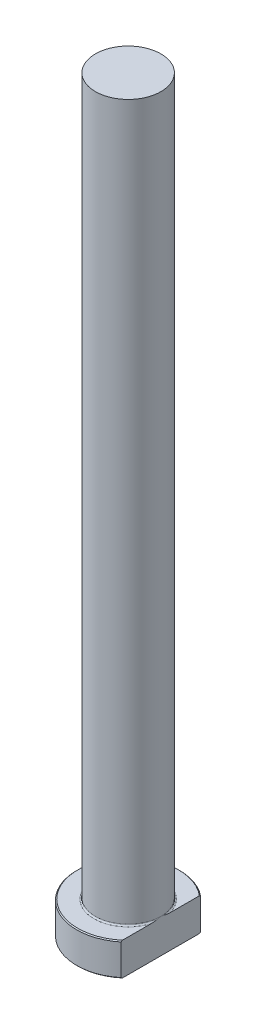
ISO-10303-21;
HEADER;
FILE_DESCRIPTION(('STEP AP214'),'2;1');
FILE_NAME('part.step','',(''),(''),'','','');
FILE_SCHEMA(('AUTOMOTIVE_DESIGN { 1 0 10303 214 1 1 1 1 }'));
ENDSEC;
DATA;
#1=APPLICATION_CONTEXT('core data for automotive mechanical design processes');
#2=APPLICATION_PROTOCOL_DEFINITION('international standard','automotive_design',2000,#1);
#3=PRODUCT_CONTEXT('',#1,'mechanical');
#4=PRODUCT('Part','Part','',(#3));
#5=PRODUCT_RELATED_PRODUCT_CATEGORY('part','',(#4));
#6=PRODUCT_DEFINITION_FORMATION('','',#4);
#7=PRODUCT_DEFINITION_CONTEXT('part definition',#1,'design');
#8=PRODUCT_DEFINITION('design','',#6,#7);
#9=PRODUCT_DEFINITION_SHAPE('','',#8);
#10=(LENGTH_UNIT() NAMED_UNIT(*) SI_UNIT(.MILLI.,.METRE.));
#11=(NAMED_UNIT(*) PLANE_ANGLE_UNIT() SI_UNIT($,.RADIAN.));
#12=(NAMED_UNIT(*) SI_UNIT($,.STERADIAN.) SOLID_ANGLE_UNIT());
#13=UNCERTAINTY_MEASURE_WITH_UNIT(LENGTH_MEASURE(1.E-05),#10,'distance_accuracy_value','');
#14=(GEOMETRIC_REPRESENTATION_CONTEXT(3) GLOBAL_UNCERTAINTY_ASSIGNED_CONTEXT((#13)) GLOBAL_UNIT_ASSIGNED_CONTEXT((#10,
#11,#12)) REPRESENTATION_CONTEXT('',''));
#15=CARTESIAN_POINT('',(0.,0.,0.));
#16=DIRECTION('',(0.,0.,1.));
#17=DIRECTION('',(1.,0.,0.));
#18=AXIS2_PLACEMENT_3D('',#15,#16,#17);
#19=CARTESIAN_POINT('',(0.,0.,0.));
#20=DIRECTION('',(0.,-1.,0.));
#21=DIRECTION('',(0.,0.,-1.));
#22=AXIS2_PLACEMENT_3D('',#19,#20,#21);
#23=PLANE('',#22);
#24=CARTESIAN_POINT('',(0.,0.,0.));
#25=DIRECTION('',(0.,-1.,0.));
#26=DIRECTION('',(0.,0.,-1.));
#27=AXIS2_PLACEMENT_3D('',#24,#25,#26);
#28=CIRCLE('',#27,10.7999999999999);
#29=CARTESIAN_POINT('',(6.99999999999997,0.,8.22435407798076));
#30=VERTEX_POINT('',#29);
#31=CARTESIAN_POINT('',(6.99999999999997,0.,-8.22435407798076));
#32=VERTEX_POINT('',#31);
#33=EDGE_CURVE('E98',#30,#32,#28,.T.);
#34=ORIENTED_EDGE('',*,*,#33,.T.);
#35=DIRECTION('',(0.,0.,1.));
#36=VECTOR('',#35,1.);
#37=CARTESIAN_POINT('',(6.99999999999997,0.,-8.48528137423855));
#38=LINE('',#37,#36);
#39=EDGE_CURVE('E83',#32,#30,#38,.T.);
#40=ORIENTED_EDGE('',*,*,#39,.T.);
#41=EDGE_LOOP('',(#34,#40));
#42=FACE_BOUND('',#41,.T.);
#43=ADVANCED_FACE('F32',(#42),#23,.T.);
#44=CARTESIAN_POINT('',(0.,259.958771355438,0.));
#45=DIRECTION('',(0.,1.,0.));
#46=DIRECTION('',(0.,0.,1.));
#47=AXIS2_PLACEMENT_3D('',#44,#45,#46);
#48=CYLINDRICAL_SURFACE('',#47,11.);
#49=CARTESIAN_POINT('',(0.,6.80000000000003,0.));
#50=DIRECTION('',(0.,1.,0.));
#51=DIRECTION('',(0.,0.,1.));
#52=AXIS2_PLACEMENT_3D('',#49,#50,#51);
#53=CIRCLE('',#52,11.);
#54=CARTESIAN_POINT('',(6.99999999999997,6.80000000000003,8.48528137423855));
#55=VERTEX_POINT('',#54);
#56=CARTESIAN_POINT('',(6.99999999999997,6.80000000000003,-8.48528137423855));
#57=VERTEX_POINT('',#56);
#58=EDGE_CURVE('E104',#55,#57,#53,.F.);
#59=ORIENTED_EDGE('',*,*,#58,.T.);
#60=DIRECTION('',(0.,-1.,0.));
#61=VECTOR('',#60,1.);
#62=CARTESIAN_POINT('',(6.99999999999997,160.,-8.48528137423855));
#63=LINE('',#62,#61);
#64=CARTESIAN_POINT('',(6.99999999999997,0.200000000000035,-8.48528137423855));
#65=VERTEX_POINT('',#64);
#66=EDGE_CURVE('E183',#57,#65,#63,.T.);
#67=ORIENTED_EDGE('',*,*,#66,.T.);
#68=CARTESIAN_POINT('',(0.,0.200000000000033,0.));
#69=DIRECTION('',(0.,-1.,0.));
#70=DIRECTION('',(0.,0.,-1.));
#71=AXIS2_PLACEMENT_3D('',#68,#69,#70);
#72=CIRCLE('',#71,11.);
#73=CARTESIAN_POINT('',(6.99999999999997,0.200000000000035,8.48528137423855));
#74=VERTEX_POINT('',#73);
#75=EDGE_CURVE('E100',#65,#74,#72,.F.);
#76=ORIENTED_EDGE('',*,*,#75,.T.);
#77=DIRECTION('',(0.,-1.,0.));
#78=VECTOR('',#77,1.);
#79=CARTESIAN_POINT('',(6.99999999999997,160.,8.48528137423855));
#80=LINE('',#79,#78);
#81=EDGE_CURVE('E93',#55,#74,#80,.T.);
#82=ORIENTED_EDGE('',*,*,#81,.F.);
#83=EDGE_LOOP('',(#59,#67,#76,#82));
#84=FACE_BOUND('',#83,.T.);
#85=ADVANCED_FACE('F158',(#84),#48,.T.);
#86=CARTESIAN_POINT('',(-11.,7.,0.));
#87=DIRECTION('',(0.,1.,0.));
#88=DIRECTION('',(0.,0.,1.));
#89=AXIS2_PLACEMENT_3D('',#86,#87,#88);
#90=PLANE('',#89);
#91=CARTESIAN_POINT('',(0.,7.,0.));
#92=DIRECTION('',(0.,1.,0.));
#93=DIRECTION('',(0.,0.,1.));
#94=AXIS2_PLACEMENT_3D('',#91,#92,#93);
#95=CIRCLE('',#94,10.8);
#96=CARTESIAN_POINT('',(6.99999999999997,7.,-8.22435407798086));
#97=VERTEX_POINT('',#96);
#98=CARTESIAN_POINT('',(6.99999999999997,7.,8.22435407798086));
#99=VERTEX_POINT('',#98);
#100=EDGE_CURVE('E178',#97,#99,#95,.T.);
#101=ORIENTED_EDGE('',*,*,#100,.T.);
#102=DIRECTION('',(0.,0.,-1.));
#103=VECTOR('',#102,1.);
#104=CARTESIAN_POINT('',(6.99999999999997,7.,0.));
#105=LINE('',#104,#103);
#106=CARTESIAN_POINT('',(6.99999999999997,6.99999999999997,2.07123151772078));
#107=VERTEX_POINT('',#106);
#108=EDGE_CURVE('E57',#99,#107,#105,.T.);
#109=ORIENTED_EDGE('',*,*,#108,.T.);
#110=CARTESIAN_POINT('',(0.,7.,0.));
#111=DIRECTION('',(0.,1.,0.));
#112=DIRECTION('',(0.,0.,1.));
#113=AXIS2_PLACEMENT_3D('',#110,#111,#112);
#114=CIRCLE('',#113,7.29999999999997);
#115=CARTESIAN_POINT('',(6.99999999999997,6.99999999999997,-2.07123151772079));
#116=VERTEX_POINT('',#115);
#117=EDGE_CURVE('E107',#107,#116,#114,.F.);
#118=ORIENTED_EDGE('',*,*,#117,.T.);
#119=EDGE_CURVE('E136',#116,#97,#105,.T.);
#120=ORIENTED_EDGE('',*,*,#119,.T.);
#121=EDGE_LOOP('',(#101,#109,#118,#120));
#122=FACE_BOUND('',#121,.T.);
#123=ADVANCED_FACE('F147',(#122),#90,.T.);
#124=CARTESIAN_POINT('',(0.,7.00000000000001,0.));
#125=DIRECTION('',(0.,-1.,0.));
#126=DIRECTION('',(0.,0.,-1.));
#127=AXIS2_PLACEMENT_3D('',#124,#125,#126);
#128=CONICAL_SURFACE('',#127,10.8,0.785398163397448);
#129=ORIENTED_EDGE('',*,*,#58,.F.);
#130=CARTESIAN_POINT('',(6.99999999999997,-2.13774979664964,18.6685261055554));
#131=CARTESIAN_POINT('',(6.99999999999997,-1.86574872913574,18.3780244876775));
#132=CARTESIAN_POINT('',(6.99999999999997,-1.59415659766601,18.0871392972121));
#133=CARTESIAN_POINT('',(6.99999999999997,-1.05192877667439,17.5044755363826));
#134=CARTESIAN_POINT('',(6.99999999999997,-0.781293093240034,17.2126969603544));
#135=CARTESIAN_POINT('',(6.99999999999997,-0.241050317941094,16.628048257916));
#136=CARTESIAN_POINT('',(6.99999999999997,0.0285564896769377,16.3351778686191));
#137=CARTESIAN_POINT('',(6.99999999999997,0.566485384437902,15.7482616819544));
#138=CARTESIAN_POINT('',(6.99999999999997,0.834807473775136,15.4542158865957));
#139=CARTESIAN_POINT('',(6.99999999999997,1.64198377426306,14.5651645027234));
#140=CARTESIAN_POINT('',(6.99999999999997,2.17856420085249,13.968084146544));
#141=CARTESIAN_POINT('',(6.99999999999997,2.97696333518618,13.0668144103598));
#142=CARTESIAN_POINT('',(6.99999999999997,3.24199785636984,12.7654727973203));
#143=CARTESIAN_POINT('',(6.99999999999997,3.76945856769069,12.160514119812));
#144=CARTESIAN_POINT('',(6.99999999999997,4.03188476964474,11.8568970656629));
#145=CARTESIAN_POINT('',(6.99999999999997,4.50733797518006,11.3009625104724));
#146=CARTESIAN_POINT('',(6.99999999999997,4.72088020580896,11.0490858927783));
#147=CARTESIAN_POINT('',(6.99999999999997,5.14538078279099,10.5431655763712));
#148=CARTESIAN_POINT('',(6.99999999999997,5.35633915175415,10.2891218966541));
#149=CARTESIAN_POINT('',(6.99999999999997,5.77522964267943,9.77836737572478));
#150=CARTESIAN_POINT('',(6.99999999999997,5.98316044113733,9.52165544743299));
#151=CARTESIAN_POINT('',(6.99999999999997,6.39521098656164,9.00519084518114));
#152=CARTESIAN_POINT('',(6.99999999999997,6.59933078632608,8.74543821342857));
#153=CARTESIAN_POINT('',(6.99999999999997,7.00243445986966,8.22283607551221));
#154=CARTESIAN_POINT('',(6.99999999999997,7.20142819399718,7.95999419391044));
#155=CARTESIAN_POINT('',(6.99999999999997,7.59353840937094,7.42991856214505));
#156=CARTESIAN_POINT('',(6.99999999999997,7.78665447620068,7.16268450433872));
#157=CARTESIAN_POINT('',(6.99999999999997,8.16523718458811,6.62311113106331));
#158=CARTESIAN_POINT('',(6.99999999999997,8.35070911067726,6.35077553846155));
#159=CARTESIAN_POINT('',(6.99999999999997,8.71189725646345,5.7997373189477));
#160=CARTESIAN_POINT('',(6.99999999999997,8.88761537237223,5.52103594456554));
#161=CARTESIAN_POINT('',(6.99999999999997,9.19554959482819,5.00707921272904));
#162=CARTESIAN_POINT('',(6.99999999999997,9.32988075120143,4.77309669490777));
#163=CARTESIAN_POINT('',(6.99999999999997,9.58764253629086,4.29911523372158));
#164=CARTESIAN_POINT('',(6.99999999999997,9.71107181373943,4.05911554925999));
#165=CARTESIAN_POINT('',(6.99999999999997,9.94390907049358,3.57263619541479));
#166=CARTESIAN_POINT('',(6.99999999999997,10.0533307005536,3.32616312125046));
#167=CARTESIAN_POINT('',(6.99999999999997,10.2545146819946,2.826071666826));
#168=CARTESIAN_POINT('',(6.99999999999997,10.3462820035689,2.57245532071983));
#169=CARTESIAN_POINT('',(6.99999999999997,10.4907049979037,2.112544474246));
#170=CARTESIAN_POINT('',(6.99999999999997,10.5475277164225,1.9075661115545));
#171=CARTESIAN_POINT('',(6.99999999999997,10.6452043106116,1.49381161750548));
#172=CARTESIAN_POINT('',(6.99999999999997,10.6860603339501,1.28503600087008));
#173=CARTESIAN_POINT('',(6.99999999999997,10.749755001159,0.865342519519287));
#174=CARTESIAN_POINT('',(6.99999999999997,10.7726462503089,0.654432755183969));
#175=CARTESIAN_POINT('',(6.99999999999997,10.7993569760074,0.231396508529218));
#176=CARTESIAN_POINT('',(6.99999999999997,10.8031771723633,0.0192700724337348));
#177=CARTESIAN_POINT('',(6.99999999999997,10.7915178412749,-0.404715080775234));
#178=CARTESIAN_POINT('',(6.99999999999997,10.77601357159,-0.616573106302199));
#179=CARTESIAN_POINT('',(6.99999999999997,10.7265413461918,-1.0381044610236));
#180=CARTESIAN_POINT('',(6.99999999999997,10.6925718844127,-1.24777761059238));
#181=CARTESIAN_POINT('',(6.99999999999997,10.607770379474,-1.66430273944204));
#182=CARTESIAN_POINT('',(6.99999999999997,10.5568873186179,-1.87114418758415));
#183=CARTESIAN_POINT('',(6.99999999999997,10.4404729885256,-2.28061279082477));
#184=CARTESIAN_POINT('',(6.99999999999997,10.3749414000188,-2.48323985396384));
#185=CARTESIAN_POINT('',(6.99999999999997,10.219098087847,-2.91860265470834));
#186=CARTESIAN_POINT('',(6.99999999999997,10.1264616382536,-3.15050038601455));
#187=CARTESIAN_POINT('',(6.99999999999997,9.9274095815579,-3.60835455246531));
#188=CARTESIAN_POINT('',(6.99999999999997,9.82098769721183,-3.83430822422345));
#189=CARTESIAN_POINT('',(6.99999999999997,9.59695142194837,-4.28105341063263));
#190=CARTESIAN_POINT('',(6.99999999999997,9.47931762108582,-4.50183511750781));
#191=CARTESIAN_POINT('',(6.99999999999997,9.23524231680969,-4.93840249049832));
#192=CARTESIAN_POINT('',(6.99999999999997,9.10880204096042,-5.15418884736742));
#193=CARTESIAN_POINT('',(6.99999999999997,8.84714657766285,-5.584179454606));
#194=CARTESIAN_POINT('',(6.99999999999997,8.71183920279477,-5.7983273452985));
#195=CARTESIAN_POINT('',(6.99999999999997,8.43533082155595,-6.22277635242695));
#196=CARTESIAN_POINT('',(6.99999999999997,8.29412966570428,-6.43307737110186));
#197=CARTESIAN_POINT('',(6.99999999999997,8.00706556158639,-6.85014007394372));
#198=CARTESIAN_POINT('',(6.99999999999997,7.8612076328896,-7.05690522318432));
#199=CARTESIAN_POINT('',(6.99999999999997,7.56553131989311,-7.46757278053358));
#200=CARTESIAN_POINT('',(6.99999999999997,7.41571298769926,-7.67147522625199));
#201=CARTESIAN_POINT('',(6.99999999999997,7.07999705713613,-8.12067189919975));
#202=CARTESIAN_POINT('',(6.99999999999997,6.89330819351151,-8.36537403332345));
#203=CARTESIAN_POINT('',(6.99999999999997,6.51597189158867,-8.85171196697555));
#204=CARTESIAN_POINT('',(6.99999999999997,6.32532432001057,-9.09334766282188));
#205=CARTESIAN_POINT('',(6.99999999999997,5.94076020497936,-9.57404667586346));
#206=CARTESIAN_POINT('',(6.99999999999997,5.74684327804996,-9.81310968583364));
#207=CARTESIAN_POINT('',(6.99999999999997,5.35630729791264,-10.2890203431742));
#208=CARTESIAN_POINT('',(6.99999999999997,5.15968820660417,-10.5258679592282));
#209=CARTESIAN_POINT('',(6.99999999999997,4.56606953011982,-11.2340330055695));
#210=CARTESIAN_POINT('',(6.99999999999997,4.16568148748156,-11.7025100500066));
#211=CARTESIAN_POINT('',(6.99999999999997,3.35840033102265,-12.6338245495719));
#212=CARTESIAN_POINT('',(6.99999999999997,2.95150704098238,-13.0966618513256));
#213=CARTESIAN_POINT('',(6.99999999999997,2.35017562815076,-13.7734103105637));
#214=CARTESIAN_POINT('',(6.99999999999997,2.15763812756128,-13.9890143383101));
#215=CARTESIAN_POINT('',(6.99999999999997,1.7716160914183,-14.4193671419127));
#216=CARTESIAN_POINT('',(6.99999999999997,1.57813157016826,-14.6341159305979));
#217=CARTESIAN_POINT('',(6.99999999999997,0.996412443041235,-15.277238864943));
#218=CARTESIAN_POINT('',(6.99999999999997,0.606922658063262,-15.7044779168));
#219=CARTESIAN_POINT('',(6.99999999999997,-0.173895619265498,-16.555652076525));
#220=CARTESIAN_POINT('',(6.99999999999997,-0.565218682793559,-16.9795921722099));
#221=CARTESIAN_POINT('',(6.99999999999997,-1.34999931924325,-17.8254589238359));
#222=CARTESIAN_POINT('',(6.99999999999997,-1.74345679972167,-18.2473856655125));
#223=CARTESIAN_POINT('',(6.99999999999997,-2.13774979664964,-18.6685261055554));
#224=B_SPLINE_CURVE_WITH_KNOTS('',3,(#130,#131,#132,#133,#134,#135,#136,#137,#138,#139,#140,
#141,#142,#143,#144,#145,#146,#147,#148,#149,#150,#151,#152,#153,#154,#155,#156,#157,#158,#159,
#160,#161,#162,#163,#164,#165,#166,#167,#168,#169,#170,#171,#172,#173,#174,#175,#176,#177,#178,
#179,#180,#181,#182,#183,#184,#185,#186,#187,#188,#189,#190,#191,#192,#193,#194,#195,#196,#197,
#198,#199,#200,#201,#202,#203,#204,#205,#206,#207,#208,#209,#210,#211,#212,#213,#214,#215,#216,
#217,#218,#219,#220,#221,#222,#223),.UNSPECIFIED.,.F.,.F.,(4,2,2,2,2,2,2,2,2,2,2,2,2,2,2,2,2,2,
2,2,2,2,2,2,2,2,2,2,2,2,2,2,2,2,2,2,2,2,2,2,2,2,2,2,2,2,4),(0.,1.19389386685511,
2.38779531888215,3.58200567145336,4.77621398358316,7.18442154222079,8.38834194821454,
9.5922568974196,10.5828886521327,11.5735117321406,12.5645555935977,13.5555857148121,
14.544540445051,15.5335647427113,16.5218934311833,17.5100293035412,18.3192088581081,
19.1284885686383,19.9369735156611,20.7452305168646,21.3828127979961,22.0203092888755,
22.6559319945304,23.2915307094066,23.9279440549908,24.5644093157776,25.2028120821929,
25.8412287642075,26.5898097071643,27.338732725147,28.0889766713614,28.8391162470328,
29.5989369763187,30.3587769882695,31.1178239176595,31.8768608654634,32.800165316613,
33.7235009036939,34.6469455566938,35.5704032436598,37.4191008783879,39.2678486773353,
40.1350269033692,41.0021920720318,42.7365692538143,44.4673795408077,46.1981154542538),.UNSPECIFIED.);
#225=EDGE_CURVE('E135',#55,#99,#224,.T.);
#226=ORIENTED_EDGE('',*,*,#225,.T.);
#227=ORIENTED_EDGE('',*,*,#100,.F.);
#228=EDGE_CURVE('E127',#97,#57,#224,.T.);
#229=ORIENTED_EDGE('',*,*,#228,.T.);
#230=EDGE_LOOP('',(#129,#226,#227,#229));
#231=FACE_BOUND('',#230,.T.);
#232=ADVANCED_FACE('F143',(#231),#128,.T.);
#233=CARTESIAN_POINT('',(0.,0.200000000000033,0.));
#234=DIRECTION('',(0.,1.,0.));
#235=DIRECTION('',(0.,0.,1.));
#236=AXIS2_PLACEMENT_3D('',#233,#234,#235);
#237=CONICAL_SURFACE('',#236,11.,0.785398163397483);
#238=ORIENTED_EDGE('',*,*,#75,.F.);
#239=CARTESIAN_POINT('',(6.99999999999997,9.13774979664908,-18.6685261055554));
#240=CARTESIAN_POINT('',(6.99999999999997,8.86574872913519,-18.3780244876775));
#241=CARTESIAN_POINT('',(6.99999999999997,8.59415659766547,-18.0871392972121));
#242=CARTESIAN_POINT('',(6.99999999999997,8.05192877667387,-17.5044755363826));
#243=CARTESIAN_POINT('',(6.99999999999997,7.78129309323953,-17.2126969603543));
#244=CARTESIAN_POINT('',(6.99999999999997,7.24105031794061,-16.6280482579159));
#245=CARTESIAN_POINT('',(6.99999999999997,6.97144351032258,-16.335177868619));
#246=CARTESIAN_POINT('',(6.99999999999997,6.43351461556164,-15.7482616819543));
#247=CARTESIAN_POINT('',(6.99999999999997,6.16519252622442,-15.4542158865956));
#248=CARTESIAN_POINT('',(6.99999999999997,5.35801622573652,-14.5651645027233));
#249=CARTESIAN_POINT('',(6.99999999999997,4.82143579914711,-13.9680841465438));
#250=CARTESIAN_POINT('',(6.99999999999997,4.02303666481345,-13.0668144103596));
#251=CARTESIAN_POINT('',(6.99999999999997,3.7580021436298,-12.7654727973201));
#252=CARTESIAN_POINT('',(6.99999999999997,3.23054143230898,-12.1605141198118));
#253=CARTESIAN_POINT('',(6.99999999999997,2.96811523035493,-11.8568970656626));
#254=CARTESIAN_POINT('',(6.99999999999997,2.4926620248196,-11.3009625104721));
#255=CARTESIAN_POINT('',(6.99999999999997,2.27911979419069,-11.0490858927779));
#256=CARTESIAN_POINT('',(6.99999999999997,1.85461921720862,-10.5431655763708));
#257=CARTESIAN_POINT('',(6.99999999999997,1.64366084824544,-10.2891218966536));
#258=CARTESIAN_POINT('',(6.99999999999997,1.22477035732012,-9.77836737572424));
#259=CARTESIAN_POINT('',(6.99999999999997,1.0168395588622,-9.52165544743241));
#260=CARTESIAN_POINT('',(6.99999999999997,0.60478901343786,-9.00519084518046));
#261=CARTESIAN_POINT('',(6.99999999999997,0.400669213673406,-8.74543821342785));
#262=CARTESIAN_POINT('',(6.99999999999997,-0.00243445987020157,-8.2228360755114));
#263=CARTESIAN_POINT('',(6.99999999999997,-0.201428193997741,-7.95999419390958));
#264=CARTESIAN_POINT('',(6.99999999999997,-0.593538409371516,-7.4299185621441));
#265=CARTESIAN_POINT('',(6.99999999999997,-0.786654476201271,-7.16268450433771));
#266=CARTESIAN_POINT('',(6.99999999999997,-1.16523718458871,-6.6231111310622));
#267=CARTESIAN_POINT('',(6.99999999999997,-1.35070911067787,-6.3507755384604));
#268=CARTESIAN_POINT('',(6.99999999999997,-1.71189725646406,-5.79973731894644));
#269=CARTESIAN_POINT('',(6.99999999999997,-1.88761537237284,-5.52103594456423));
#270=CARTESIAN_POINT('',(6.99999999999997,-2.19554959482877,-5.00707921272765));
#271=CARTESIAN_POINT('',(6.99999999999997,-2.32988075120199,-4.77309669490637));
#272=CARTESIAN_POINT('',(6.99999999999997,-2.58764253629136,-4.29911523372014));
#273=CARTESIAN_POINT('',(6.99999999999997,-2.7110718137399,-4.05911554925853));
#274=CARTESIAN_POINT('',(6.99999999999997,-2.94390907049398,-3.5726361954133));
#275=CARTESIAN_POINT('',(6.99999999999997,-3.05333070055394,-3.32616312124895));
#276=CARTESIAN_POINT('',(6.99999999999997,-3.25451468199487,-2.82607166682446));
#277=CARTESIAN_POINT('',(6.99999999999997,-3.34628200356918,-2.57245532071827));
#278=CARTESIAN_POINT('',(6.99999999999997,-3.49070499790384,-2.11254447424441));
#279=CARTESIAN_POINT('',(6.99999999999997,-3.54752771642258,-1.90756611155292));
#280=CARTESIAN_POINT('',(6.99999999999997,-3.64520431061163,-1.49381161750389));
#281=CARTESIAN_POINT('',(6.99999999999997,-3.68606033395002,-1.2850360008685));
#282=CARTESIAN_POINT('',(6.99999999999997,-3.74975500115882,-0.865342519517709));
#283=CARTESIAN_POINT('',(6.99999999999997,-3.77264625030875,-0.654432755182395));
#284=CARTESIAN_POINT('',(6.99999999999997,-3.79935697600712,-0.231396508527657));
#285=CARTESIAN_POINT('',(6.99999999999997,-3.80317717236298,-0.0192700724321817));
#286=CARTESIAN_POINT('',(6.99999999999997,-3.79151784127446,0.404715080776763));
#287=CARTESIAN_POINT('',(6.99999999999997,-3.77601357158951,0.61657310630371));
#288=CARTESIAN_POINT('',(6.99999999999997,-3.72654134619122,1.03810446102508));
#289=CARTESIAN_POINT('',(6.99999999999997,-3.69257188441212,1.24777761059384));
#290=CARTESIAN_POINT('',(6.99999999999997,-3.60777037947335,1.66430273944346));
#291=CARTESIAN_POINT('',(6.99999999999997,-3.55688731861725,1.87114418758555));
#292=CARTESIAN_POINT('',(6.99999999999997,-3.44047298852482,2.28061279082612));
#293=CARTESIAN_POINT('',(6.99999999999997,-3.374941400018,2.48323985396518));
#294=CARTESIAN_POINT('',(6.99999999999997,-3.2190980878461,2.91860265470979));
#295=CARTESIAN_POINT('',(6.99999999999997,-3.12646163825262,3.15050038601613));
#296=CARTESIAN_POINT('',(6.99999999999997,-2.92740958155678,3.60835455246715));
#297=CARTESIAN_POINT('',(6.99999999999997,-2.82098769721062,3.83430822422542));
#298=CARTESIAN_POINT('',(6.99999999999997,-2.59695142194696,4.28105341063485));
#299=CARTESIAN_POINT('',(6.99999999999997,-2.4793176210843,4.50183511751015));
#300=CARTESIAN_POINT('',(6.99999999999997,-2.23524231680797,4.9384024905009));
#301=CARTESIAN_POINT('',(6.99999999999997,-2.1088020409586,5.15418884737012));
#302=CARTESIAN_POINT('',(6.99999999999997,-1.84714657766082,5.58417945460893));
#303=CARTESIAN_POINT('',(6.99999999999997,-1.71183920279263,5.79832734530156));
#304=CARTESIAN_POINT('',(6.99999999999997,-1.43533082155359,6.22277635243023));
#305=CARTESIAN_POINT('',(6.99999999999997,-1.29412966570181,6.43307737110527));
#306=CARTESIAN_POINT('',(6.99999999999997,-1.00706556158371,6.85014007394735));
#307=CARTESIAN_POINT('',(6.99999999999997,-0.861207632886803,7.05690522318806));
#308=CARTESIAN_POINT('',(6.99999999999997,-0.5655313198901,7.46757278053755));
#309=CARTESIAN_POINT('',(6.99999999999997,-0.415712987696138,7.67147522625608));
#310=CARTESIAN_POINT('',(6.99999999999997,-0.0799970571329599,8.12067189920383));
#311=CARTESIAN_POINT('',(6.99999999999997,0.10669180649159,8.36537403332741));
#312=CARTESIAN_POINT('',(6.99999999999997,0.484028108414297,8.85171196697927));
#313=CARTESIAN_POINT('',(6.99999999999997,0.674675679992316,9.09334766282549));
#314=CARTESIAN_POINT('',(6.99999999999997,1.05923979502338,9.57404667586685));
#315=CARTESIAN_POINT('',(6.99999999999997,1.25315672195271,9.81310968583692));
#316=CARTESIAN_POINT('',(6.99999999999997,1.64369270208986,10.2890203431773));
#317=CARTESIAN_POINT('',(6.99999999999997,1.84031179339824,10.5258679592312));
#318=CARTESIAN_POINT('',(6.99999999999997,2.43393046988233,11.2340330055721));
#319=CARTESIAN_POINT('',(6.99999999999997,2.83431851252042,11.702510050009));
#320=CARTESIAN_POINT('',(6.99999999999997,3.64159966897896,12.633824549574));
#321=CARTESIAN_POINT('',(6.99999999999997,4.04849295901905,13.0966618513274));
#322=CARTESIAN_POINT('',(6.99999999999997,4.64982437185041,13.7734103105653));
#323=CARTESIAN_POINT('',(6.99999999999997,4.84236187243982,13.9890143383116));
#324=CARTESIAN_POINT('',(6.99999999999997,5.22838390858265,14.4193671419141));
#325=CARTESIAN_POINT('',(6.99999999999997,5.42186842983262,14.6341159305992));
#326=CARTESIAN_POINT('',(6.99999999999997,6.00358755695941,15.2772388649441));
#327=CARTESIAN_POINT('',(6.99999999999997,6.39307734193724,15.7044779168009));
#328=CARTESIAN_POINT('',(6.99999999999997,7.17389561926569,16.5556520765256));
#329=CARTESIAN_POINT('',(6.99999999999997,7.5652186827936,16.9795921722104));
#330=CARTESIAN_POINT('',(6.99999999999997,8.34999931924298,17.8254589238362));
#331=CARTESIAN_POINT('',(6.99999999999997,8.74345679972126,18.2473856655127));
#332=CARTESIAN_POINT('',(6.99999999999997,9.13774979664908,18.6685261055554));
#333=B_SPLINE_CURVE_WITH_KNOTS('',3,(#239,#240,#241,#242,#243,#244,#245,#246,#247,#248,#249,
#250,#251,#252,#253,#254,#255,#256,#257,#258,#259,#260,#261,#262,#263,#264,#265,#266,#267,#268,
#269,#270,#271,#272,#273,#274,#275,#276,#277,#278,#279,#280,#281,#282,#283,#284,#285,#286,#287,
#288,#289,#290,#291,#292,#293,#294,#295,#296,#297,#298,#299,#300,#301,#302,#303,#304,#305,#306,
#307,#308,#309,#310,#311,#312,#313,#314,#315,#316,#317,#318,#319,#320,#321,#322,#323,#324,#325,
#326,#327,#328,#329,#330,#331,#332),.UNSPECIFIED.,.F.,.F.,(4,2,2,2,2,2,2,2,2,2,2,2,2,2,2,2,2,2,
2,2,2,2,2,2,2,2,2,2,2,2,2,2,2,2,2,2,2,2,2,2,2,2,2,2,2,2,4),(0.,1.19389386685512,
2.38779531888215,3.58200567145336,4.77621398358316,7.18442154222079,8.38834194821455,
9.59225689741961,10.5828886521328,11.5735117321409,12.5645555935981,13.5555857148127,
14.5445404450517,15.5335647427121,16.5218934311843,17.5100293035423,18.3192088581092,
19.1284885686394,19.9369735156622,20.7452305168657,21.3828127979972,22.0203092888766,
22.6559319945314,23.2915307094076,23.9279440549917,24.5644093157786,25.2028120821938,
25.8412287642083,26.5898097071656,27.3387327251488,28.0889766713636,28.8391162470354,
29.5989369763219,30.3587769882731,31.1178239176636,31.876860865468,32.8001653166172,
33.7235009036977,34.6469455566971,35.5704032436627,37.41910087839,39.2678486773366,
40.1350269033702,41.0021920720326,42.7365692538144,44.4673795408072,46.1981154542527),.UNSPECIFIED.);
#334=EDGE_CURVE('E86',#65,#32,#333,.T.);
#335=ORIENTED_EDGE('',*,*,#334,.T.);
#336=ORIENTED_EDGE('',*,*,#33,.F.);
#337=EDGE_CURVE('E89',#30,#74,#333,.T.);
#338=ORIENTED_EDGE('',*,*,#337,.T.);
#339=EDGE_LOOP('',(#238,#335,#336,#338));
#340=FACE_BOUND('',#339,.T.);
#341=ADVANCED_FACE('F97',(#340),#237,.T.);
#342=CARTESIAN_POINT('',(0.,7.29999999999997,0.));
#343=DIRECTION('',(0.,1.,0.));
#344=DIRECTION('',(0.,0.,1.));
#345=AXIS2_PLACEMENT_3D('',#342,#343,#344);
#346=TOROIDAL_SURFACE('',#345,7.29999999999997,0.3);
#347=CARTESIAN_POINT('',(6.99999999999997,7.29999999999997,0.));
#348=CARTESIAN_POINT('',(6.99999999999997,7.30000062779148,2.32628005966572E-11));
#349=CARTESIAN_POINT('',(6.99999999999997,7.30000125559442,-3.16909134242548E-07));
#350=CARTESIAN_POINT('',(6.99999999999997,7.30000241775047,-1.14637029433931E-06));
#351=CARTESIAN_POINT('',(6.99999999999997,7.30000292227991,-1.68168827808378E-06));
#352=CARTESIAN_POINT('',(6.99999999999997,7.30000400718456,-2.97869768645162E-06));
#353=CARTESIAN_POINT('',(6.99999999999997,7.30000456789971,-3.76131367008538E-06));
#354=CARTESIAN_POINT('',(6.99999999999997,7.30000553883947,-5.35167977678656E-06));
#355=CARTESIAN_POINT('',(6.99999999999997,7.30000595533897,-6.15604635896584E-06));
#356=CARTESIAN_POINT('',(6.99999999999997,7.30000758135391,-9.388029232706E-06));
#357=CARTESIAN_POINT('',(6.99999999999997,7.30000871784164,-1.18573464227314E-05));
#358=CARTESIAN_POINT('',(6.99999999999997,7.30001050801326,-1.66549715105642E-05));
#359=CARTESIAN_POINT('',(6.99999999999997,7.30001120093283,-1.89691200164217E-05));
#360=CARTESIAN_POINT('',(6.99999999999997,7.30001423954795,-2.9073526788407E-05));
#361=CARTESIAN_POINT('',(6.99999999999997,7.30001661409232,-3.68567169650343E-05));
#362=CARTESIAN_POINT('',(6.99999999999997,7.30001997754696,-5.13387672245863E-05));
#363=CARTESIAN_POINT('',(6.99999999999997,7.30002113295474,-5.79981986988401E-05));
#364=CARTESIAN_POINT('',(6.99999999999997,7.30002974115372,-0.000108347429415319));
#365=CARTESIAN_POINT('',(6.99999999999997,7.30003649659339,-0.000152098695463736));
#366=CARTESIAN_POINT('',(6.99999999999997,7.30006604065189,-0.000326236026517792));
#367=CARTESIAN_POINT('',(6.99999999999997,7.30009398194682,-0.000455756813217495));
#368=CARTESIAN_POINT('',(6.99999999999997,7.30020370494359,-0.000971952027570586));
#369=CARTESIAN_POINT('',(6.99999999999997,7.30028233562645,-0.00135905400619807));
#370=CARTESIAN_POINT('',(6.99999999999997,7.30059908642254,-0.00290811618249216));
#371=CARTESIAN_POINT('',(6.99999999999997,7.30084128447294,-0.00406949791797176));
#372=CARTESIAN_POINT('',(6.99999999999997,7.30185637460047,-0.00894870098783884));
#373=CARTESIAN_POINT('',(6.99999999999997,7.30262406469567,-0.0126672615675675));
#374=CARTESIAN_POINT('',(6.99999999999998,7.30904362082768,-0.0437472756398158));
#375=CARTESIAN_POINT('',(6.99999999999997,7.31471492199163,-0.0711060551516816));
#376=CARTESIAN_POINT('',(6.99999999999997,7.3257989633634,-0.124711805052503));
#377=CARTESIAN_POINT('',(6.99999999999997,7.33121280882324,-0.150958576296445));
#378=CARTESIAN_POINT('',(6.99999999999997,7.34888721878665,-0.236855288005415));
#379=CARTESIAN_POINT('',(6.99999999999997,7.36109504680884,-0.296516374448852));
#380=CARTESIAN_POINT('',(6.99999999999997,7.38163193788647,-0.398125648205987));
#381=CARTESIAN_POINT('',(6.99999999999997,7.39003371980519,-0.440059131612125));
#382=CARTESIAN_POINT('',(6.99999999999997,7.40641913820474,-0.522820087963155));
#383=CARTESIAN_POINT('',(6.99999999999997,7.41440792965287,-0.563646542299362));
#384=CARTESIAN_POINT('',(6.99999999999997,7.44025584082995,-0.697745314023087));
#385=CARTESIAN_POINT('',(6.99999999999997,7.45763052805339,-0.791112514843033));
#386=CARTESIAN_POINT('',(6.99999999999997,7.4907040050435,-0.979068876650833));
#387=CARTESIAN_POINT('',(6.99999999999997,7.50638514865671,-1.07366117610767));
#388=CARTESIAN_POINT('',(6.99999999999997,7.53649600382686,-1.27237182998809));
#389=CARTESIAN_POINT('',(6.99999999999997,7.55066037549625,-1.37653153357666));
#390=CARTESIAN_POINT('',(6.99999999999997,7.57450660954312,-1.58508707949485));
#391=CARTESIAN_POINT('',(6.99999999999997,7.58420070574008,-1.68948148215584));
#392=CARTESIAN_POINT('',(6.99999999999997,7.5971656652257,-1.89515538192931));
#393=CARTESIAN_POINT('',(6.99999999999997,7.60064432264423,-1.9964196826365));
#394=CARTESIAN_POINT('',(6.99999999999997,7.59954163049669,-2.14745317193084));
#395=CARTESIAN_POINT('',(6.99999999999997,7.59815772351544,-2.19724153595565));
#396=CARTESIAN_POINT('',(6.99999999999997,7.59283451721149,-2.29666246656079));
#397=CARTESIAN_POINT('',(6.99999999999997,7.58889656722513,-2.34629510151));
#398=CARTESIAN_POINT('',(6.99999999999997,7.57769755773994,-2.44571674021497));
#399=CARTESIAN_POINT('',(6.99999999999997,7.57040396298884,-2.49550242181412));
#400=CARTESIAN_POINT('',(6.99999999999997,7.5560244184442,-2.56951537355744));
#401=CARTESIAN_POINT('',(6.99999999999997,7.55065780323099,-2.59407625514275));
#402=CARTESIAN_POINT('',(6.99999999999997,7.53852479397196,-2.642845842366));
#403=CARTESIAN_POINT('',(6.99999999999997,7.53175908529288,-2.66705471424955));
#404=CARTESIAN_POINT('',(6.99999999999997,7.5174892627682,-2.71174649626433));
#405=CARTESIAN_POINT('',(6.99999999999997,7.510201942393,-2.73229789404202));
#406=CARTESIAN_POINT('',(6.99999999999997,7.4939308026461,-2.77282387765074));
#407=CARTESIAN_POINT('',(6.99999999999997,7.4849410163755,-2.79279614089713));
#408=CARTESIAN_POINT('',(6.99999999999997,7.46462265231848,-2.83190553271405));
#409=CARTESIAN_POINT('',(6.99999999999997,7.45326134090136,-2.85102586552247));
#410=CARTESIAN_POINT('',(6.99999999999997,7.4274542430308,-2.88704231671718));
#411=CARTESIAN_POINT('',(6.99999999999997,7.41303489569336,-2.90395561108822));
#412=CARTESIAN_POINT('',(6.99999999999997,7.39049681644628,-2.92384155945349));
#413=CARTESIAN_POINT('',(6.99999999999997,7.3841904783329,-2.92884725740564));
#414=CARTESIAN_POINT('',(6.99999999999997,7.3709718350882,-2.9380049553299));
#415=CARTESIAN_POINT('',(6.99999999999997,7.36405938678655,-2.94215675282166));
#416=CARTESIAN_POINT('',(6.99999999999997,7.34956926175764,-2.94936604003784));
#417=CARTESIAN_POINT('',(6.99999999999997,7.34198467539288,-2.95240998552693));
#418=CARTESIAN_POINT('',(6.99999999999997,7.32637763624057,-2.95700924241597));
#419=CARTESIAN_POINT('',(6.99999999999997,7.31835605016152,-2.95856739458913));
#420=CARTESIAN_POINT('',(6.99999999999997,7.3029104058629,-2.95992508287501));
#421=CARTESIAN_POINT('',(6.99999999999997,7.29549953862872,-2.95987367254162));
#422=CARTESIAN_POINT('',(6.99999999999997,7.28081803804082,-2.95838504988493));
#423=CARTESIAN_POINT('',(6.99999999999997,7.27354749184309,-2.95694700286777));
#424=CARTESIAN_POINT('',(6.99999999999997,7.25853285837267,-2.95260391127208));
#425=CARTESIAN_POINT('',(6.99999999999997,7.25083383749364,-2.94954604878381));
#426=CARTESIAN_POINT('',(6.99999999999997,7.23603628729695,-2.9422241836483));
#427=CARTESIAN_POINT('',(6.99999999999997,7.22893877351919,-2.93795819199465));
#428=CARTESIAN_POINT('',(6.99999999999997,7.21163875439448,-2.92593351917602));
#429=CARTESIAN_POINT('',(6.99999999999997,7.20187862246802,-2.91754511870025));
#430=CARTESIAN_POINT('',(6.99999999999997,7.18370674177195,-2.89942475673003));
#431=CARTESIAN_POINT('',(6.99999999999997,7.17529892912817,-2.88968902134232));
#432=CARTESIAN_POINT('',(6.99999999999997,7.15199560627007,-2.85953893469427));
#433=CARTESIAN_POINT('',(6.99999999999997,7.13869481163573,-2.83790736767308));
#434=CARTESIAN_POINT('',(6.99999999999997,7.11507068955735,-2.79314645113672));
#435=CARTESIAN_POINT('',(6.99999999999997,7.10475206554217,-2.77001480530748));
#436=CARTESIAN_POINT('',(6.99999999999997,7.08155610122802,-2.7108784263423));
#437=CARTESIAN_POINT('',(6.99999999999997,7.07006528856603,-2.67433519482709));
#438=CARTESIAN_POINT('',(6.99999999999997,7.05044959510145,-2.60033159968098));
#439=CARTESIAN_POINT('',(6.99999999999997,7.04233234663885,-2.5628693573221));
#440=CARTESIAN_POINT('',(6.99999999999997,7.02853576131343,-2.48688638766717));
#441=CARTESIAN_POINT('',(6.99999999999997,7.02289758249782,-2.4483583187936));
#442=CARTESIAN_POINT('',(6.99999999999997,7.01369461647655,-2.37112071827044));
#443=CARTESIAN_POINT('',(6.99999999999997,7.01012698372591,-2.33241150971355));
#444=CARTESIAN_POINT('',(6.99999999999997,7.00239886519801,-2.22280038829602));
#445=CARTESIAN_POINT('',(6.99999999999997,7.00019016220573,-2.15176184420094));
#446=CARTESIAN_POINT('',(6.99999999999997,6.99983406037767,-2.0096618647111));
#447=CARTESIAN_POINT('',(6.99999999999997,7.00168936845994,-1.9386004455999));
#448=CARTESIAN_POINT('',(6.99999999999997,7.00854815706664,-1.79630907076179));
#449=CARTESIAN_POINT('',(6.99999999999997,7.01356610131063,-1.7250798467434));
#450=CARTESIAN_POINT('',(6.99999999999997,7.02608998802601,-1.5828366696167));
#451=CARTESIAN_POINT('',(6.99999999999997,7.03359634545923,-1.51182275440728));
#452=CARTESIAN_POINT('',(6.99999999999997,7.0575822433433,-1.31152735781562));
#453=CARTESIAN_POINT('',(6.99999999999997,7.07635481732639,-1.18252326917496));
#454=CARTESIAN_POINT('',(6.99999999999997,7.11790553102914,-0.926646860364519));
#455=CARTESIAN_POINT('',(6.99999999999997,7.14063741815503,-0.799766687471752));
#456=CARTESIAN_POINT('',(6.99999999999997,7.17322033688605,-0.627620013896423));
#457=CARTESIAN_POINT('',(6.99999999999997,7.18199317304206,-0.582145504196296));
#458=CARTESIAN_POINT('',(6.99999999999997,7.20004716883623,-0.489938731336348));
#459=CARTESIAN_POINT('',(6.99999999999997,7.20933569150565,-0.443207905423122));
#460=CARTESIAN_POINT('',(6.99999999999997,7.22546843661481,-0.362914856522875));
#461=CARTESIAN_POINT('',(6.99999999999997,7.23226586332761,-0.329343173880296));
#462=CARTESIAN_POINT('',(6.99999999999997,7.24586025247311,-0.262588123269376));
#463=CARTESIAN_POINT('',(6.99999999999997,7.25265638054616,-0.22940458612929));
#464=CARTESIAN_POINT('',(6.99999999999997,7.26550614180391,-0.166874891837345));
#465=CARTESIAN_POINT('',(6.99999999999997,7.27155497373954,-0.137527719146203));
#466=CARTESIAN_POINT('',(6.99999999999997,7.28394498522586,-0.0775831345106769));
#467=CARTESIAN_POINT('',(6.99999999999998,7.29028759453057,-0.0469859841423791));
#468=CARTESIAN_POINT('',(6.99999999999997,7.29737625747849,-0.0126656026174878));
#469=CARTESIAN_POINT('',(6.99999999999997,7.29814430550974,-0.00894538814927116));
#470=CARTESIAN_POINT('',(6.99999999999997,7.29915947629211,-0.00406582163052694));
#471=CARTESIAN_POINT('',(6.99999999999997,7.29940140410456,-0.00290573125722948));
#472=CARTESIAN_POINT('',(6.99999999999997,7.29971782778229,-0.00135826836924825));
#473=CARTESIAN_POINT('',(6.99999999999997,7.29979639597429,-0.000971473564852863));
#474=CARTESIAN_POINT('',(6.99999999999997,7.29990604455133,-0.000455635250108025));
#475=CARTESIAN_POINT('',(6.99999999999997,7.2999339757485,-0.00032616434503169));
#476=CARTESIAN_POINT('',(6.99999999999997,7.29996351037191,-0.000152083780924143));
#477=CARTESIAN_POINT('',(6.99999999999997,7.29997026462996,-0.000108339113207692));
#478=CARTESIAN_POINT('',(6.99999999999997,7.29997887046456,-5.7996672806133E-05));
#479=CARTESIAN_POINT('',(6.99999999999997,7.29998002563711,-5.13375704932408E-05));
#480=CARTESIAN_POINT('',(6.99999999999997,7.29998338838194,-3.6856228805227E-05));
#481=CARTESIAN_POINT('',(6.99999999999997,7.29998576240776,-2.90734013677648E-05));
#482=CARTESIAN_POINT('',(6.99999999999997,7.29998880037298,-1.8969379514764E-05));
#483=CARTESIAN_POINT('',(6.99999999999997,7.29998949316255,-1.6655255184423E-05));
#484=CARTESIAN_POINT('',(6.99999999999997,7.29999128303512,-1.18576604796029E-05));
#485=CARTESIAN_POINT('',(6.99999999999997,7.29999241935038,-9.38834597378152E-06));
#486=CARTESIAN_POINT('',(6.99999999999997,7.29999404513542,-6.15634598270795E-06));
#487=CARTESIAN_POINT('',(6.99999999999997,7.29999446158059,-5.35196743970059E-06));
#488=CARTESIAN_POINT('',(6.99999999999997,7.29999543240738,-3.76156762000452E-06));
#489=CARTESIAN_POINT('',(6.99999999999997,7.29999599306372,-2.97892931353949E-06));
#490=CARTESIAN_POINT('',(6.99999999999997,7.29999707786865,-1.68186918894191E-06));
#491=CARTESIAN_POINT('',(6.99999999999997,7.29999758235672,-1.14652503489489E-06));
#492=CARTESIAN_POINT('',(6.99999999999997,7.2999987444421,-3.16995271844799E-07));
#493=CARTESIAN_POINT('',(6.99999999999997,7.29999937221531,-2.32625469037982E-11));
#494=CARTESIAN_POINT('',(6.99999999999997,7.29999999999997,0.));
#495=B_SPLINE_CURVE_WITH_KNOTS('',3,(#347,#348,#349,#350,#351,#352,#353,#354,#355,#356,#357,
#358,#359,#360,#361,#362,#363,#364,#365,#366,#367,#368,#369,#370,#371,#372,#373,#374,#375,#376,
#377,#378,#379,#380,#381,#382,#383,#384,#385,#386,#387,#388,#389,#390,#391,#392,#393,#394,#395,
#396,#397,#398,#399,#400,#401,#402,#403,#404,#405,#406,#407,#408,#409,#410,#411,#412,#413,#414,
#415,#416,#417,#418,#419,#420,#421,#422,#423,#424,#425,#426,#427,#428,#429,#430,#431,#432,#433,
#434,#435,#436,#437,#438,#439,#440,#441,#442,#443,#444,#445,#446,#447,#448,#449,#450,#451,#452,
#453,#454,#455,#456,#457,#458,#459,#460,#461,#462,#463,#464,#465,#466,#467,#468,#469,#470,#471,
#472,#473,#474,#475,#476,#477,#478,#479,#480,#481,#482,#483,#484,#485,#486,#487,#488,#489,#490,
#491,#492,#493,#494),.UNSPECIFIED.,.T.,.F.,(4,2,2,2,2,2,2,2,2,2,2,2,2,2,2,2,2,2,2,2,2,2,2,2,2,2,
2,2,2,2,2,2,2,2,2,2,2,2,2,2,2,2,2,2,2,2,2,2,2,2,2,2,2,2,2,2,2,2,2,2,2,2,2,2,2,2,2,2,2,2,2,2,2,
4),(0.,1.92694204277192E-06,4.154269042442E-06,7.01948468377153E-06,9.73677790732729E-06,
1.78669784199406E-05,2.510708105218E-05,4.94892168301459E-05,6.97447136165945E-05,
0.000202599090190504,0.000599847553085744,0.00178514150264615,0.00534391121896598,
0.0167352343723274,0.100554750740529,0.180953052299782,0.36364407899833,0.491944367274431,
0.616746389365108,0.901643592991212,1.18926961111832,1.50455392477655,1.81897020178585,
2.12266301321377,2.27203455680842,2.42132724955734,2.57209897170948,2.64748997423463,
2.72284413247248,2.7882086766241,2.85380670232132,2.92037838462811,2.98639639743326,
3.01049823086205,3.03460577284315,3.05899886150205,3.08334521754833,3.10544427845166,
3.12755665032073,3.15227309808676,3.17703047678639,3.21542082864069,3.25392097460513,
3.32967543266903,3.4055487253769,3.52018968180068,3.63508860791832,3.75182904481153,
3.86840866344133,4.08144496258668,4.29462320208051,4.5087835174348,4.72297956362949,
5.11393929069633,5.50060554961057,5.63954426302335,5.78247850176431,5.8852372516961,
5.98685401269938,6.07674665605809,6.17048759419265,6.18188399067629,6.18543880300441,
6.18662315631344,6.18702025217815,6.18715308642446,6.18717334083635,6.18719772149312,
6.18720496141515,6.18721309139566,6.1872158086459,6.18721867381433,6.18722090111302,
6.18722282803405),.UNSPECIFIED.);
#496=CARTESIAN_POINT('',(6.99999999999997,7.29999999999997,0.));
#497=VERTEX_POINT('',#496);
#498=EDGE_CURVE('E11',#116,#497,#495,.T.);
#499=ORIENTED_EDGE('',*,*,#498,.F.);
#500=ORIENTED_EDGE('',*,*,#117,.F.);
#501=CARTESIAN_POINT('',(6.99999999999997,7.29999999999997,0.));
#502=CARTESIAN_POINT('',(6.99999999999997,7.29999937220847,-2.32626743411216E-11));
#503=CARTESIAN_POINT('',(6.99999999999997,7.29999874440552,3.16909134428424E-07));
#504=CARTESIAN_POINT('',(6.99999999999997,7.29999758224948,1.14637029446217E-06));
#505=CARTESIAN_POINT('',(6.99999999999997,7.29999707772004,1.68168827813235E-06));
#506=CARTESIAN_POINT('',(6.99999999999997,7.29999599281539,2.97869768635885E-06));
#507=CARTESIAN_POINT('',(6.99999999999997,7.29999543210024,3.76131366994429E-06));
#508=CARTESIAN_POINT('',(6.99999999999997,7.29999446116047,5.35167977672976E-06));
#509=CARTESIAN_POINT('',(6.99999999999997,7.29999404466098,6.15604635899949E-06));
#510=CARTESIAN_POINT('',(6.99999999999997,7.29999241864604,9.38802923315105E-06));
#511=CARTESIAN_POINT('',(6.99999999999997,7.29999128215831,1.18573464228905E-05));
#512=CARTESIAN_POINT('',(6.99999999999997,7.29998949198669,1.66549715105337E-05));
#513=CARTESIAN_POINT('',(6.99999999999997,7.29998879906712,1.8969120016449E-05));
#514=CARTESIAN_POINT('',(6.99999999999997,7.29998576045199,2.90735267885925E-05));
#515=CARTESIAN_POINT('',(6.99999999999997,7.29998338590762,3.68567169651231E-05));
#516=CARTESIAN_POINT('',(6.99999999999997,7.29998002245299,5.13387672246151E-05));
#517=CARTESIAN_POINT('',(6.99999999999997,7.2999788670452,5.7998198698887E-05));
#518=CARTESIAN_POINT('',(6.99999999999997,7.29997025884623,0.00010834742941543));
#519=CARTESIAN_POINT('',(6.99999999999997,7.29996350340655,0.000152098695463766));
#520=CARTESIAN_POINT('',(6.99999999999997,7.29993395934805,0.000326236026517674));
#521=CARTESIAN_POINT('',(6.99999999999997,7.29990601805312,0.000455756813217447));
#522=CARTESIAN_POINT('',(6.99999999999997,7.29979629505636,0.0009719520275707));
#523=CARTESIAN_POINT('',(6.99999999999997,7.2997176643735,0.00135905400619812));
#524=CARTESIAN_POINT('',(6.99999999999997,7.29940091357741,0.00290811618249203));
#525=CARTESIAN_POINT('',(6.99999999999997,7.29915871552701,0.0040694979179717));
#526=CARTESIAN_POINT('',(6.99999999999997,7.29814362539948,0.00894870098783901));
#527=CARTESIAN_POINT('',(6.99999999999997,7.29737593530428,0.0126672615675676));
#528=CARTESIAN_POINT('',(6.99999999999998,7.29095637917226,0.0437472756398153));
#529=CARTESIAN_POINT('',(6.99999999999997,7.28528507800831,0.0711060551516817));
#530=CARTESIAN_POINT('',(6.99999999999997,7.27420103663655,0.124711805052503));
#531=CARTESIAN_POINT('',(6.99999999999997,7.2687871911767,0.150958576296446));
#532=CARTESIAN_POINT('',(6.99999999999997,7.25111278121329,0.236855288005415));
#533=CARTESIAN_POINT('',(6.99999999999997,7.23890495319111,0.296516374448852));
#534=CARTESIAN_POINT('',(6.99999999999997,7.21836806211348,0.398125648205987));
#535=CARTESIAN_POINT('',(6.99999999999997,7.20996628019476,0.440059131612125));
#536=CARTESIAN_POINT('',(6.99999999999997,7.1935808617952,0.522820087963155));
#537=CARTESIAN_POINT('',(6.99999999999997,7.18559207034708,0.563646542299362));
#538=CARTESIAN_POINT('',(6.99999999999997,7.15974415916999,0.697745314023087));
#539=CARTESIAN_POINT('',(6.99999999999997,7.14236947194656,0.791112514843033));
#540=CARTESIAN_POINT('',(6.99999999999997,7.10929599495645,0.979068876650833));
#541=CARTESIAN_POINT('',(6.99999999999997,7.09361485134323,1.07366117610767));
#542=CARTESIAN_POINT('',(6.99999999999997,7.06350399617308,1.27237182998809));
#543=CARTESIAN_POINT('',(6.99999999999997,7.04933962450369,1.37653153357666));
#544=CARTESIAN_POINT('',(6.99999999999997,7.02549339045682,1.58508707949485));
#545=CARTESIAN_POINT('',(6.99999999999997,7.01579929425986,1.68948148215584));
#546=CARTESIAN_POINT('',(6.99999999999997,7.00283433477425,1.89515538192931));
#547=CARTESIAN_POINT('',(6.99999999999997,6.99935567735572,1.9964196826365));
#548=CARTESIAN_POINT('',(6.99999999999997,7.00045836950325,2.14745317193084));
#549=CARTESIAN_POINT('',(6.99999999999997,7.0018422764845,2.19724153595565));
#550=CARTESIAN_POINT('',(6.99999999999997,7.00716548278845,2.29666246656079));
#551=CARTESIAN_POINT('',(6.99999999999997,7.01110343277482,2.34629510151));
#552=CARTESIAN_POINT('',(6.99999999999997,7.02230244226,2.44571674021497));
#553=CARTESIAN_POINT('',(6.99999999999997,7.02959603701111,2.49550242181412));
#554=CARTESIAN_POINT('',(6.99999999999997,7.04397558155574,2.56951537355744));
#555=CARTESIAN_POINT('',(6.99999999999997,7.04934219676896,2.59407625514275));
#556=CARTESIAN_POINT('',(6.99999999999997,7.06147520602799,2.642845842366));
#557=CARTESIAN_POINT('',(6.99999999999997,7.06824091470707,2.66705471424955));
#558=CARTESIAN_POINT('',(6.99999999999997,7.08251073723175,2.71174649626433));
#559=CARTESIAN_POINT('',(6.99999999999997,7.08979805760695,2.73229789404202));
#560=CARTESIAN_POINT('',(6.99999999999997,7.10606919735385,2.77282387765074));
#561=CARTESIAN_POINT('',(6.99999999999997,7.11505898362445,2.79279614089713));
#562=CARTESIAN_POINT('',(6.99999999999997,7.13537734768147,2.83190553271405));
#563=CARTESIAN_POINT('',(6.99999999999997,7.14673865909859,2.85102586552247));
#564=CARTESIAN_POINT('',(6.99999999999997,7.17254575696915,2.88704231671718));
#565=CARTESIAN_POINT('',(6.99999999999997,7.18696510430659,2.90395561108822));
#566=CARTESIAN_POINT('',(6.99999999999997,7.20950318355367,2.92384155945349));
#567=CARTESIAN_POINT('',(6.99999999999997,7.21580952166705,2.92884725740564));
#568=CARTESIAN_POINT('',(6.99999999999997,7.22902816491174,2.9380049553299));
#569=CARTESIAN_POINT('',(6.99999999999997,7.2359406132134,2.94215675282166));
#570=CARTESIAN_POINT('',(6.99999999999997,7.2504307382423,2.94936604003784));
#571=CARTESIAN_POINT('',(6.99999999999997,7.25801532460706,2.95240998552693));
#572=CARTESIAN_POINT('',(6.99999999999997,7.27362236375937,2.95700924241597));
#573=CARTESIAN_POINT('',(6.99999999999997,7.28164394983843,2.95856739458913));
#574=CARTESIAN_POINT('',(6.99999999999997,7.29708959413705,2.95992508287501));
#575=CARTESIAN_POINT('',(6.99999999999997,7.30450046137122,2.95987367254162));
#576=CARTESIAN_POINT('',(6.99999999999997,7.31918196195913,2.95838504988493));
#577=CARTESIAN_POINT('',(6.99999999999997,7.32645250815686,2.95694700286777));
#578=CARTESIAN_POINT('',(6.99999999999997,7.34146714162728,2.95260391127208));
#579=CARTESIAN_POINT('',(6.99999999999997,7.34916616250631,2.94954604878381));
#580=CARTESIAN_POINT('',(6.99999999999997,7.363963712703,2.9422241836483));
#581=CARTESIAN_POINT('',(6.99999999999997,7.37106122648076,2.93795819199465));
#582=CARTESIAN_POINT('',(6.99999999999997,7.38836124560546,2.92593351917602));
#583=CARTESIAN_POINT('',(6.99999999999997,7.39812137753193,2.91754511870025));
#584=CARTESIAN_POINT('',(6.99999999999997,7.416293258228,2.89942475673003));
#585=CARTESIAN_POINT('',(6.99999999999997,7.42470107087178,2.88968902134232));
#586=CARTESIAN_POINT('',(6.99999999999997,7.44800439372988,2.85953893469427));
#587=CARTESIAN_POINT('',(6.99999999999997,7.46130518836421,2.83790736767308));
#588=CARTESIAN_POINT('',(6.99999999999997,7.4849293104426,2.79314645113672));
#589=CARTESIAN_POINT('',(6.99999999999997,7.49524793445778,2.77001480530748));
#590=CARTESIAN_POINT('',(6.99999999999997,7.51844389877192,2.7108784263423));
#591=CARTESIAN_POINT('',(6.99999999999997,7.52993471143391,2.67433519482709));
#592=CARTESIAN_POINT('',(6.99999999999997,7.5495504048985,2.60033159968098));
#593=CARTESIAN_POINT('',(6.99999999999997,7.55766765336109,2.5628693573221));
#594=CARTESIAN_POINT('',(6.99999999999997,7.57146423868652,2.48688638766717));
#595=CARTESIAN_POINT('',(6.99999999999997,7.57710241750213,2.4483583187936));
#596=CARTESIAN_POINT('',(6.99999999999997,7.5863053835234,2.37112071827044));
#597=CARTESIAN_POINT('',(6.99999999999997,7.58987301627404,2.33241150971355));
#598=CARTESIAN_POINT('',(6.99999999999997,7.59760113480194,2.22280038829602));
#599=CARTESIAN_POINT('',(6.99999999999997,7.59980983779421,2.15176184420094));
#600=CARTESIAN_POINT('',(6.99999999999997,7.60016593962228,2.0096618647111));
#601=CARTESIAN_POINT('',(6.99999999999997,7.59831063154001,1.9386004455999));
#602=CARTESIAN_POINT('',(6.99999999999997,7.5914518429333,1.79630907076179));
#603=CARTESIAN_POINT('',(6.99999999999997,7.58643389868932,1.7250798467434));
#604=CARTESIAN_POINT('',(6.99999999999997,7.57391001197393,1.5828366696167));
#605=CARTESIAN_POINT('',(6.99999999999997,7.56640365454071,1.51182275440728));
#606=CARTESIAN_POINT('',(6.99999999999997,7.54241775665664,1.31152735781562));
#607=CARTESIAN_POINT('',(6.99999999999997,7.52364518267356,1.18252326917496));
#608=CARTESIAN_POINT('',(6.99999999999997,7.48209446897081,0.926646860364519));
#609=CARTESIAN_POINT('',(6.99999999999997,7.45936258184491,0.799766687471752));
#610=CARTESIAN_POINT('',(6.99999999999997,7.4267796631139,0.627620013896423));
#611=CARTESIAN_POINT('',(6.99999999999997,7.41800682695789,0.582145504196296));
#612=CARTESIAN_POINT('',(6.99999999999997,7.39995283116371,0.489938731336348));
#613=CARTESIAN_POINT('',(6.99999999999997,7.3906643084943,0.443207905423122));
#614=CARTESIAN_POINT('',(6.99999999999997,7.37453156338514,0.362914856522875));
#615=CARTESIAN_POINT('',(6.99999999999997,7.36773413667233,0.329343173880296));
#616=CARTESIAN_POINT('',(6.99999999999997,7.35413974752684,0.262588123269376));
#617=CARTESIAN_POINT('',(6.99999999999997,7.34734361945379,0.22940458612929));
#618=CARTESIAN_POINT('',(6.99999999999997,7.33449385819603,0.166874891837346));
#619=CARTESIAN_POINT('',(6.99999999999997,7.32844502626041,0.137527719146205));
#620=CARTESIAN_POINT('',(6.99999999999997,7.31605501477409,0.0775831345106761));
#621=CARTESIAN_POINT('',(6.99999999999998,7.30971240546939,0.0469859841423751));
#622=CARTESIAN_POINT('',(6.99999999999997,7.30262374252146,0.0126656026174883));
#623=CARTESIAN_POINT('',(6.99999999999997,7.3018556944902,0.00894538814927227));
#624=CARTESIAN_POINT('',(6.99999999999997,7.30084052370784,0.00406582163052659));
#625=CARTESIAN_POINT('',(6.99999999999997,7.30059859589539,0.00290573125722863));
#626=CARTESIAN_POINT('',(6.99999999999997,7.30028217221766,0.00135826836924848));
#627=CARTESIAN_POINT('',(6.99999999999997,7.30020360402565,0.000971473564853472));
#628=CARTESIAN_POINT('',(6.99999999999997,7.30009395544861,0.000455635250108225));
#629=CARTESIAN_POINT('',(6.99999999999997,7.30006602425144,0.000326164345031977));
#630=CARTESIAN_POINT('',(6.99999999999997,7.30003648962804,0.000152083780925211));
#631=CARTESIAN_POINT('',(6.99999999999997,7.30002973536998,0.000108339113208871));
#632=CARTESIAN_POINT('',(6.99999999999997,7.30002112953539,5.79966728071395E-05));
#633=CARTESIAN_POINT('',(6.99999999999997,7.30001997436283,5.133757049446E-05));
#634=CARTESIAN_POINT('',(6.99999999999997,7.30001661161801,3.68562288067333E-05));
#635=CARTESIAN_POINT('',(6.99999999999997,7.30001423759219,2.90734013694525E-05));
#636=CARTESIAN_POINT('',(6.99999999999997,7.30001119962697,1.89693795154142E-05));
#637=CARTESIAN_POINT('',(6.99999999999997,7.3000105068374,1.66552551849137E-05));
#638=CARTESIAN_POINT('',(6.99999999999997,7.30000871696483,1.18576604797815E-05));
#639=CARTESIAN_POINT('',(6.99999999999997,7.30000758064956,9.38834597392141E-06));
#640=CARTESIAN_POINT('',(6.99999999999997,7.30000595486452,6.15634598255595E-06));
#641=CARTESIAN_POINT('',(6.99999999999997,7.30000553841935,5.35196743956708E-06));
#642=CARTESIAN_POINT('',(6.99999999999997,7.30000456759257,3.76156761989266E-06));
#643=CARTESIAN_POINT('',(6.99999999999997,7.30000400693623,2.97892931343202E-06));
#644=CARTESIAN_POINT('',(6.99999999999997,7.3000029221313,1.68186918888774E-06));
#645=CARTESIAN_POINT('',(6.99999999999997,7.30000241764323,1.14652503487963E-06));
#646=CARTESIAN_POINT('',(6.99999999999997,7.30000125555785,3.16995271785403E-07));
#647=CARTESIAN_POINT('',(6.99999999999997,7.30000062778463,2.32624206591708E-11));
#648=CARTESIAN_POINT('',(6.99999999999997,7.29999999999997,0.));
#649=B_SPLINE_CURVE_WITH_KNOTS('',3,(#501,#502,#503,#504,#505,#506,#507,#508,#509,#510,#511,
#512,#513,#514,#515,#516,#517,#518,#519,#520,#521,#522,#523,#524,#525,#526,#527,#528,#529,#530,
#531,#532,#533,#534,#535,#536,#537,#538,#539,#540,#541,#542,#543,#544,#545,#546,#547,#548,#549,
#550,#551,#552,#553,#554,#555,#556,#557,#558,#559,#560,#561,#562,#563,#564,#565,#566,#567,#568,
#569,#570,#571,#572,#573,#574,#575,#576,#577,#578,#579,#580,#581,#582,#583,#584,#585,#586,#587,
#588,#589,#590,#591,#592,#593,#594,#595,#596,#597,#598,#599,#600,#601,#602,#603,#604,#605,#606,
#607,#608,#609,#610,#611,#612,#613,#614,#615,#616,#617,#618,#619,#620,#621,#622,#623,#624,#625,
#626,#627,#628,#629,#630,#631,#632,#633,#634,#635,#636,#637,#638,#639,#640,#641,#642,#643,#644,
#645,#646,#647,#648),.UNSPECIFIED.,.T.,.F.,(4,2,2,2,2,2,2,2,2,2,2,2,2,2,2,2,2,2,2,2,2,2,2,2,2,2,
2,2,2,2,2,2,2,2,2,2,2,2,2,2,2,2,2,2,2,2,2,2,2,2,2,2,2,2,2,2,2,2,2,2,2,2,2,2,2,2,2,2,2,2,2,2,2,
4),(0.,1.92694204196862E-06,4.15426904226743E-06,7.01948468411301E-06,9.73677790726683E-06,
1.78669784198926E-05,2.51070810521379E-05,4.94892168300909E-05,6.9744713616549E-05,
0.000202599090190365,0.000599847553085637,0.00178514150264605,0.00534391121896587,
0.0167352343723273,0.10055475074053,0.180953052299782,0.36364407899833,0.491944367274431,
0.616746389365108,0.901643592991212,1.18926961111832,1.50455392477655,1.81897020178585,
2.12266301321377,2.27203455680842,2.42132724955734,2.57209897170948,2.64748997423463,
2.72284413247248,2.7882086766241,2.85380670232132,2.92037838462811,2.98639639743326,
3.01049823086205,3.03460577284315,3.05899886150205,3.08334521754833,3.10544427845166,
3.12755665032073,3.15227309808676,3.17703047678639,3.21542082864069,3.25392097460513,
3.32967543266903,3.4055487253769,3.52018968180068,3.63508860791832,3.75182904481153,
3.86840866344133,4.08144496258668,4.29462320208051,4.5087835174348,4.72297956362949,
5.11393929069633,5.50060554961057,5.63954426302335,5.78247850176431,5.8852372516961,
5.98685401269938,6.07674665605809,6.17048759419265,6.18188399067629,6.18543880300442,
6.18662315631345,6.18702025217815,6.18715308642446,6.18717334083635,6.18719772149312,
6.18720496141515,6.18721309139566,6.1872158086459,6.18721867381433,6.18722090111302,
6.18722282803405),.UNSPECIFIED.);
#650=EDGE_CURVE('E46',#497,#107,#649,.T.);
#651=ORIENTED_EDGE('',*,*,#650,.F.);
#652=CARTESIAN_POINT('',(0.,7.29999999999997,0.));
#653=DIRECTION('',(0.,1.,0.));
#654=DIRECTION('',(0.,0.,1.));
#655=AXIS2_PLACEMENT_3D('',#652,#653,#654);
#656=CIRCLE('',#655,6.99999999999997);
#657=EDGE_CURVE('E103',#497,#497,#656,.T.);
#658=ORIENTED_EDGE('',*,*,#657,.F.);
#659=EDGE_LOOP('',(#499,#500,#651,#658));
#660=FACE_BOUND('',#659,.T.);
#661=ADVANCED_FACE('F34',(#660),#346,.F.);
#662=CARTESIAN_POINT('',(0.,259.958771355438,0.));
#663=DIRECTION('',(0.,1.,0.));
#664=DIRECTION('',(0.,0.,1.));
#665=AXIS2_PLACEMENT_3D('',#662,#663,#664);
#666=CYLINDRICAL_SURFACE('',#665,6.99999999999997);
#667=ORIENTED_EDGE('',*,*,#657,.T.);
#668=EDGE_LOOP('',(#667));
#669=FACE_BOUND('',#668,.T.);
#670=CARTESIAN_POINT('',(0.,160.,0.));
#671=DIRECTION('',(0.,1.,0.));
#672=DIRECTION('',(0.,0.,1.));
#673=AXIS2_PLACEMENT_3D('',#670,#671,#672);
#674=CIRCLE('',#673,6.99999999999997);
#675=CARTESIAN_POINT('',(0.,160.,6.99999999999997));
#676=VERTEX_POINT('',#675);
#677=EDGE_CURVE('E101',#676,#676,#674,.T.);
#678=ORIENTED_EDGE('',*,*,#677,.F.);
#679=EDGE_LOOP('',(#678));
#680=FACE_BOUND('',#679,.T.);
#681=ADVANCED_FACE('F155',(#669,#680),#666,.T.);
#682=CARTESIAN_POINT('',(-6.99999999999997,160.,0.));
#683=DIRECTION('',(0.,1.,0.));
#684=DIRECTION('',(0.,0.,1.));
#685=AXIS2_PLACEMENT_3D('',#682,#683,#684);
#686=PLANE('',#685);
#687=ORIENTED_EDGE('',*,*,#677,.T.);
#688=EDGE_LOOP('',(#687));
#689=FACE_BOUND('',#688,.T.);
#690=ADVANCED_FACE('F121',(#689),#686,.T.);
#691=CARTESIAN_POINT('',(6.99999999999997,160.,-8.48528137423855));
#692=DIRECTION('',(1.,0.,0.));
#693=DIRECTION('',(0.,0.,-1.));
#694=AXIS2_PLACEMENT_3D('',#691,#692,#693);
#695=PLANE('',#694);
#696=ORIENTED_EDGE('',*,*,#66,.F.);
#697=ORIENTED_EDGE('',*,*,#228,.F.);
#698=ORIENTED_EDGE('',*,*,#119,.F.);
#699=ORIENTED_EDGE('',*,*,#498,.T.);
#700=ORIENTED_EDGE('',*,*,#650,.T.);
#701=ORIENTED_EDGE('',*,*,#108,.F.);
#702=ORIENTED_EDGE('',*,*,#225,.F.);
#703=ORIENTED_EDGE('',*,*,#81,.T.);
#704=ORIENTED_EDGE('',*,*,#337,.F.);
#705=ORIENTED_EDGE('',*,*,#39,.F.);
#706=ORIENTED_EDGE('',*,*,#334,.F.);
#707=EDGE_LOOP('',(#696,#697,#698,#699,#700,#701,#702,#703,#704,#705,#706));
#708=FACE_BOUND('',#707,.T.);
#709=ADVANCED_FACE('F85',(#708),#695,.T.);
#710=CLOSED_SHELL('',(#43,#85,#123,#232,#341,#661,#681,#690,#709));
#711=MANIFOLD_SOLID_BREP('B2',#710);
#712=ADVANCED_BREP_SHAPE_REPRESENTATION('',(#18,#711),#14);
#713=SHAPE_DEFINITION_REPRESENTATION(#9,#712);
ENDSEC;
END-ISO-10303-21;
